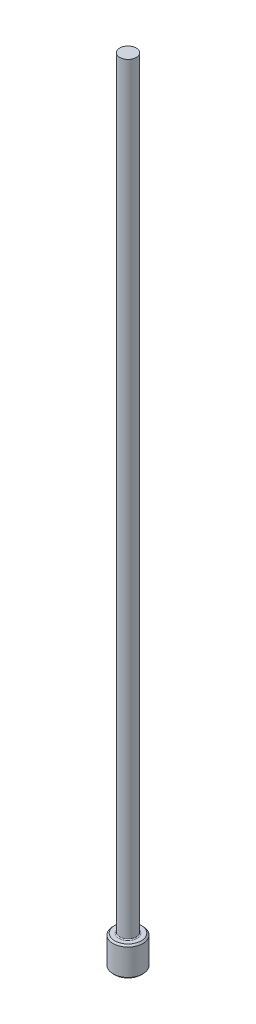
from build123d import *

# Parameters (mm, degrees)
CHAMFER1_SIZE = 0.127
FILLET1_R     = 0.0762


with BuildPart() as part:
    # Sketch1 → Revolve1 (revolve)
    with BuildSketch(Plane.XY, mode=Mode.PRIVATE) as revolve1_sk:
        Polygon((0, 0), (-1.1938, 0), (-1.1938, 2.3622), (-0.6604, 2.3622), (-0.6604, 63.5), (0, 63.5), align=None)
    revolve(revolve1_sk.sketch.rotate(Axis((0, 259.958771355, 0), (0, -1, 0)), 270), axis=Axis((0, 259.958771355, 0), (0, -1, 0)))

    # Chamfer1
    chamfer1_edges = [part.edges().sort_by_distance(p)[0] for p in [
        (0, 2.3622, -1.1938),
        (0, 0, -1.1938),
    ]]
    chamfer(chamfer1_edges, length=CHAMFER1_SIZE)

    # Fillet1
    fillet1_edges = [part.edges().sort_by_distance(p)[0] for p in [
        (0, 2.3622, -0.6604),
    ]]
    fillet(fillet1_edges, radius=FILLET1_R)


solid = part.part
